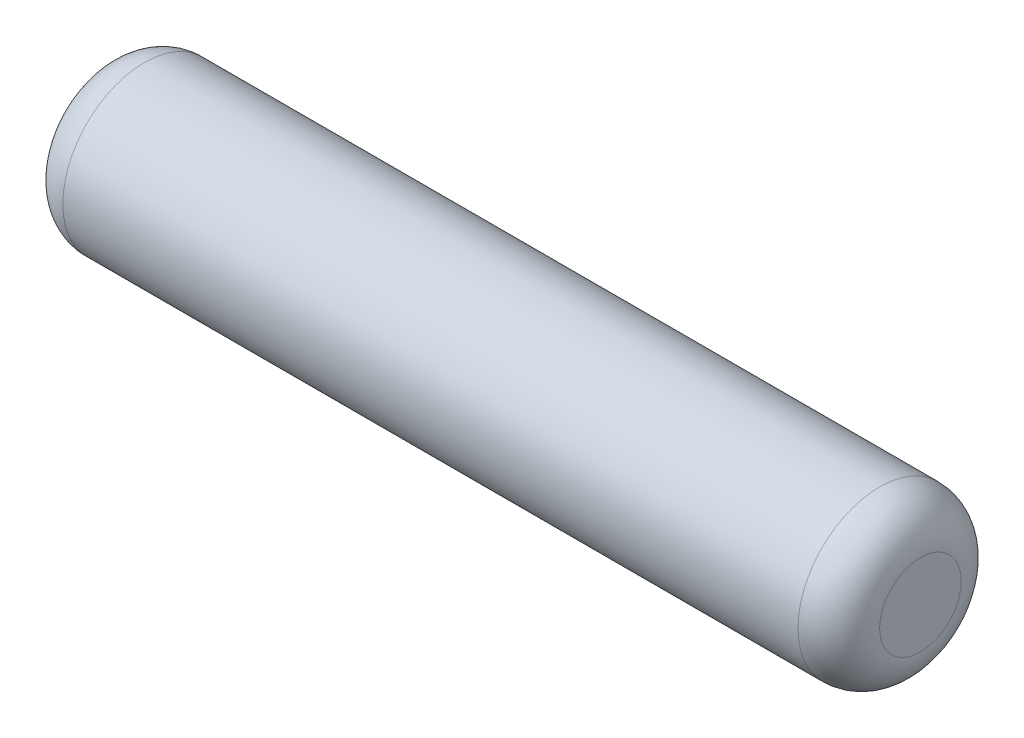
ISO-10303-21;
HEADER;
FILE_DESCRIPTION(('STEP AP214'),'2;1');
FILE_NAME('part.step','',(''),(''),'','','');
FILE_SCHEMA(('AUTOMOTIVE_DESIGN { 1 0 10303 214 1 1 1 1 }'));
ENDSEC;
DATA;
#1=APPLICATION_CONTEXT('core data for automotive mechanical design processes');
#2=APPLICATION_PROTOCOL_DEFINITION('international standard','automotive_design',2000,#1);
#3=PRODUCT_CONTEXT('',#1,'mechanical');
#4=PRODUCT('Part','Part','',(#3));
#5=PRODUCT_RELATED_PRODUCT_CATEGORY('part','',(#4));
#6=PRODUCT_DEFINITION_FORMATION('','',#4);
#7=PRODUCT_DEFINITION_CONTEXT('part definition',#1,'design');
#8=PRODUCT_DEFINITION('design','',#6,#7);
#9=PRODUCT_DEFINITION_SHAPE('','',#8);
#10=(LENGTH_UNIT() NAMED_UNIT(*) SI_UNIT(.MILLI.,.METRE.));
#11=(NAMED_UNIT(*) PLANE_ANGLE_UNIT() SI_UNIT($,.RADIAN.));
#12=(NAMED_UNIT(*) SI_UNIT($,.STERADIAN.) SOLID_ANGLE_UNIT());
#13=UNCERTAINTY_MEASURE_WITH_UNIT(LENGTH_MEASURE(1.E-05),#10,'distance_accuracy_value','');
#14=(GEOMETRIC_REPRESENTATION_CONTEXT(3) GLOBAL_UNCERTAINTY_ASSIGNED_CONTEXT((#13)) GLOBAL_UNIT_ASSIGNED_CONTEXT((#10,
#11,#12)) REPRESENTATION_CONTEXT('',''));
#15=CARTESIAN_POINT('',(0.,0.,0.));
#16=DIRECTION('',(0.,0.,1.));
#17=DIRECTION('',(1.,0.,0.));
#18=AXIS2_PLACEMENT_3D('',#15,#16,#17);
#19=CARTESIAN_POINT('',(0.,0.,0.));
#20=DIRECTION('',(1.,0.,0.));
#21=DIRECTION('',(0.,0.,-1.));
#22=AXIS2_PLACEMENT_3D('',#19,#20,#21);
#23=PLANE('',#22);
#24=CARTESIAN_POINT('',(0.,0.,0.));
#25=DIRECTION('',(1.,0.,0.));
#26=DIRECTION('',(0.,0.,-1.));
#27=AXIS2_PLACEMENT_3D('',#24,#25,#26);
#28=CIRCLE('',#27,2.);
#29=CARTESIAN_POINT('',(0.,0.,-2.));
#30=VERTEX_POINT('',#29);
#31=EDGE_CURVE('E30',#30,#30,#28,.F.);
#32=ORIENTED_EDGE('',*,*,#31,.T.);
#33=EDGE_LOOP('',(#32));
#34=FACE_BOUND('',#33,.T.);
#35=ADVANCED_FACE('F15',(#34),#23,.F.);
#36=CARTESIAN_POINT('',(0.,0.,0.));
#37=DIRECTION('',(-1.,0.,0.));
#38=DIRECTION('',(0.,0.,1.));
#39=AXIS2_PLACEMENT_3D('',#36,#37,#38);
#40=CYLINDRICAL_SURFACE('',#39,4.);
#41=CARTESIAN_POINT('',(2.,0.,0.));
#42=DIRECTION('',(1.,0.,0.));
#43=DIRECTION('',(0.,0.,-1.));
#44=AXIS2_PLACEMENT_3D('',#41,#42,#43);
#45=CIRCLE('',#44,4.);
#46=CARTESIAN_POINT('',(2.,0.,-4.));
#47=VERTEX_POINT('',#46);
#48=EDGE_CURVE('E22',#47,#47,#45,.T.);
#49=ORIENTED_EDGE('',*,*,#48,.T.);
#50=EDGE_LOOP('',(#49));
#51=FACE_BOUND('',#50,.T.);
#52=CARTESIAN_POINT('',(38.,0.,0.));
#53=DIRECTION('',(-1.,0.,0.));
#54=DIRECTION('',(0.,0.,1.));
#55=AXIS2_PLACEMENT_3D('',#52,#53,#54);
#56=CIRCLE('',#55,4.);
#57=CARTESIAN_POINT('',(38.,0.,4.));
#58=VERTEX_POINT('',#57);
#59=EDGE_CURVE('E26',#58,#58,#56,.T.);
#60=ORIENTED_EDGE('',*,*,#59,.T.);
#61=EDGE_LOOP('',(#60));
#62=FACE_BOUND('',#61,.T.);
#63=ADVANCED_FACE('F48',(#51,#62),#40,.T.);
#64=CARTESIAN_POINT('',(40.,4.,0.));
#65=DIRECTION('',(-1.,0.,0.));
#66=DIRECTION('',(0.,0.,1.));
#67=AXIS2_PLACEMENT_3D('',#64,#65,#66);
#68=PLANE('',#67);
#69=CARTESIAN_POINT('',(40.,0.,0.));
#70=DIRECTION('',(-1.,0.,0.));
#71=DIRECTION('',(0.,0.,1.));
#72=AXIS2_PLACEMENT_3D('',#69,#70,#71);
#73=CIRCLE('',#72,2.);
#74=CARTESIAN_POINT('',(40.,0.,2.));
#75=VERTEX_POINT('',#74);
#76=EDGE_CURVE('E10',#75,#75,#73,.F.);
#77=ORIENTED_EDGE('',*,*,#76,.T.);
#78=EDGE_LOOP('',(#77));
#79=FACE_BOUND('',#78,.T.);
#80=ADVANCED_FACE('F39',(#79),#68,.F.);
#81=CARTESIAN_POINT('',(2.,0.,0.));
#82=DIRECTION('',(1.,0.,0.));
#83=DIRECTION('',(0.,0.,-1.));
#84=AXIS2_PLACEMENT_3D('',#81,#82,#83);
#85=DEGENERATE_TOROIDAL_SURFACE('',#84,2.,2.,.T.);
#86=ORIENTED_EDGE('',*,*,#48,.F.);
#87=EDGE_LOOP('',(#86));
#88=FACE_BOUND('',#87,.T.);
#89=ORIENTED_EDGE('',*,*,#31,.F.);
#90=EDGE_LOOP('',(#89));
#91=FACE_BOUND('',#90,.T.);
#92=ADVANCED_FACE('F37',(#88,#91),#85,.T.);
#93=CARTESIAN_POINT('',(38.,0.,0.));
#94=DIRECTION('',(-1.,0.,0.));
#95=DIRECTION('',(0.,0.,1.));
#96=AXIS2_PLACEMENT_3D('',#93,#94,#95);
#97=DEGENERATE_TOROIDAL_SURFACE('',#96,2.,2.,.T.);
#98=ORIENTED_EDGE('',*,*,#76,.F.);
#99=EDGE_LOOP('',(#98));
#100=FACE_BOUND('',#99,.T.);
#101=ORIENTED_EDGE('',*,*,#59,.F.);
#102=EDGE_LOOP('',(#101));
#103=FACE_BOUND('',#102,.T.);
#104=ADVANCED_FACE('F17',(#100,#103),#97,.T.);
#105=CLOSED_SHELL('',(#35,#63,#80,#92,#104));
#106=MANIFOLD_SOLID_BREP('B1',#105);
#107=ADVANCED_BREP_SHAPE_REPRESENTATION('',(#18,#106),#14);
#108=SHAPE_DEFINITION_REPRESENTATION(#9,#107);
ENDSEC;
END-ISO-10303-21;
